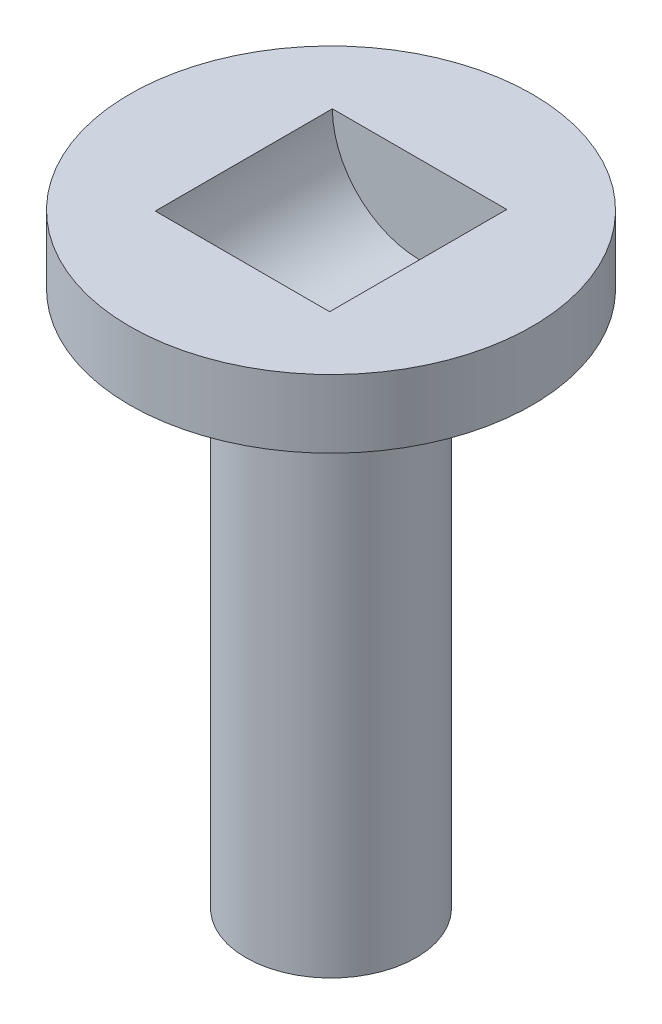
from build123d import *

# Parameters (mm, degrees)
SKETCH1_R               = 3.175
BOSS_EXTRUDE1_DEPTH     = 20
SKETCH2_R               = 1.35
CUT_EXTRUDE1_DEPTH      = 10
SKETCH4_R               = 7.5
BOSS_EXTRUDE2_DEPTH     = 2.54
SKETCH6_R               = 4.85
BOSS_EXTRUDE3_DEPTH     = 3.35
CUT_EXTRUDE3_DEPTH      = 3.3
CUT_EXTRUDE3_DEPTH_BACK = 3.302
SKETCH5_R               = 3.25


with BuildPart() as part:
    # Sketch1 → Boss-Extrude1 (new body)
    with BuildSketch(Plane(origin=(0, 0, 0), x_dir=(1, 0, 0), z_dir=(0, 1, 0))):
        with Locations(Location((0, 0, 0), (0, 0, 270))):
            Circle(SKETCH1_R)
    extrude(amount=BOSS_EXTRUDE1_DEPTH)

    # Sketch2 → Cut-Extrude1 (cut)
    with BuildSketch(Plane.XZ):
        with Locations(Location((0, 0, 0), (0, 0, 270))):
            Circle(SKETCH2_R)
    extrude(amount=-CUT_EXTRUDE1_DEPTH, mode=Mode.SUBTRACT)

    # Sketch4 → Boss-Extrude2 (add)
    with BuildSketch(Plane(origin=(0, 20, 0), x_dir=(1, 0, 0), z_dir=(0, 1, 0))):
        with Locations(Location((0, 0, 0), (0, 0, 270))):
            Circle(SKETCH4_R)
    extrude(amount=BOSS_EXTRUDE2_DEPTH)

    # Sketch6 → Boss-Extrude3 (add)
    with BuildSketch(Plane(origin=(0, 22.54, 0), x_dir=(1, 0, 0), z_dir=(0, 1, 0))):
        with Locations(Location((0, 0, 0), (0, 0, 270))):
            Circle(SKETCH6_R)
    extrude(amount=-BOSS_EXTRUDE3_DEPTH)

    # Sketch5 → Cut-Extrude3 (cut, two sides: drawn at the far end of the back side and taken through both)
    with BuildSketch(Plane.XY.offset(-CUT_EXTRUDE3_DEPTH_BACK)):
        with Locations((0, 22.54)):
            Circle(SKETCH5_R)
    extrude(amount=CUT_EXTRUDE3_DEPTH + CUT_EXTRUDE3_DEPTH_BACK, mode=Mode.SUBTRACT)


solid = part.part
